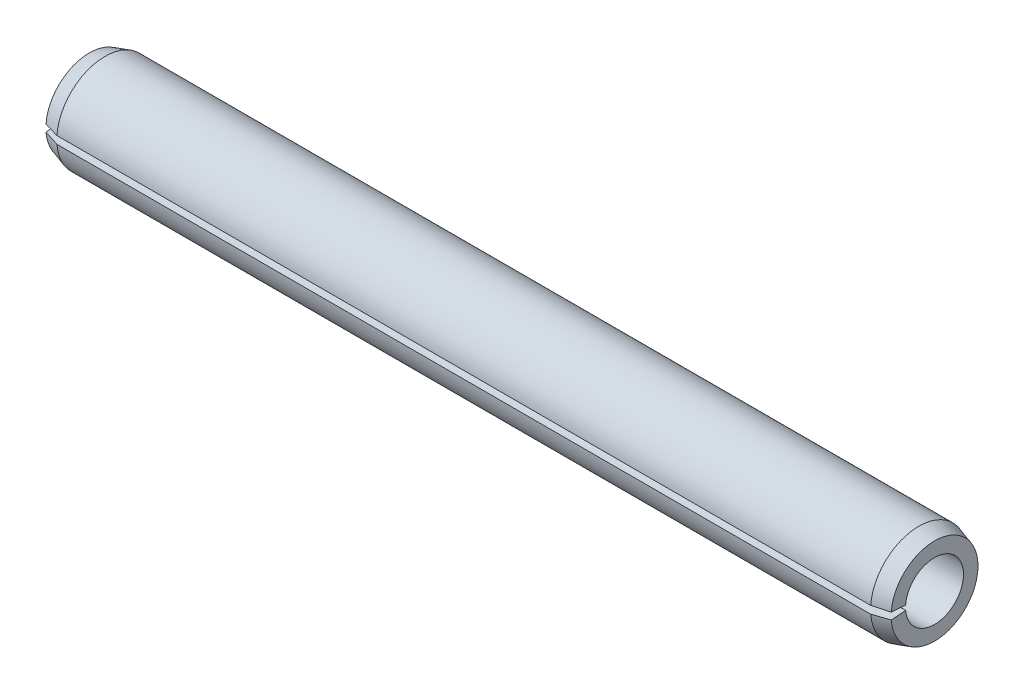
ISO-10303-21;
HEADER;
FILE_DESCRIPTION(('STEP AP214'),'2;1');
FILE_NAME('part.step','',(''),(''),'','','');
FILE_SCHEMA(('AUTOMOTIVE_DESIGN { 1 0 10303 214 1 1 1 1 }'));
ENDSEC;
DATA;
#1=APPLICATION_CONTEXT('core data for automotive mechanical design processes');
#2=APPLICATION_PROTOCOL_DEFINITION('international standard','automotive_design',2000,#1);
#3=PRODUCT_CONTEXT('',#1,'mechanical');
#4=PRODUCT('Part','Part','',(#3));
#5=PRODUCT_RELATED_PRODUCT_CATEGORY('part','',(#4));
#6=PRODUCT_DEFINITION_FORMATION('','',#4);
#7=PRODUCT_DEFINITION_CONTEXT('part definition',#1,'design');
#8=PRODUCT_DEFINITION('design','',#6,#7);
#9=PRODUCT_DEFINITION_SHAPE('','',#8);
#10=(LENGTH_UNIT() NAMED_UNIT(*) SI_UNIT(.MILLI.,.METRE.));
#11=(NAMED_UNIT(*) PLANE_ANGLE_UNIT() SI_UNIT($,.RADIAN.));
#12=(NAMED_UNIT(*) SI_UNIT($,.STERADIAN.) SOLID_ANGLE_UNIT());
#13=UNCERTAINTY_MEASURE_WITH_UNIT(LENGTH_MEASURE(1.E-05),#10,'distance_accuracy_value','');
#14=(GEOMETRIC_REPRESENTATION_CONTEXT(3) GLOBAL_UNCERTAINTY_ASSIGNED_CONTEXT((#13)) GLOBAL_UNIT_ASSIGNED_CONTEXT((#10,
#11,#12)) REPRESENTATION_CONTEXT('',''));
#15=CARTESIAN_POINT('',(0.,0.,0.));
#16=DIRECTION('',(0.,0.,1.));
#17=DIRECTION('',(1.,0.,0.));
#18=AXIS2_PLACEMENT_3D('',#15,#16,#17);
#19=CARTESIAN_POINT('',(0.,1.8,0.));
#20=DIRECTION('',(1.,0.,0.));
#21=DIRECTION('',(0.,0.,-1.));
#22=AXIS2_PLACEMENT_3D('',#19,#20,#21);
#23=PLANE('',#22);
#24=DIRECTION('',(0.,0.0784590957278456,0.996917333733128));
#25=VECTOR('',#24,1.);
#26=CARTESIAN_POINT('',(0.,0.,0.));
#27=LINE('',#26,#25);
#28=CARTESIAN_POINT('',(0.,0.0941509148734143,1.19630080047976));
#29=VERTEX_POINT('',#28);
#30=CARTESIAN_POINT('',(0.,0.141226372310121,1.79445120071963));
#31=VERTEX_POINT('',#30);
#32=EDGE_CURVE('E85',#29,#31,#27,.T.);
#33=ORIENTED_EDGE('',*,*,#32,.T.);
#34=CARTESIAN_POINT('',(0.,0.,0.));
#35=DIRECTION('',(-1.,0.,0.));
#36=DIRECTION('',(0.,0.,1.));
#37=AXIS2_PLACEMENT_3D('',#34,#35,#36);
#38=CIRCLE('',#37,1.8);
#39=CARTESIAN_POINT('',(0.,-0.141226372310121,1.79445120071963));
#40=VERTEX_POINT('',#39);
#41=EDGE_CURVE('E103',#31,#40,#38,.T.);
#42=ORIENTED_EDGE('',*,*,#41,.T.);
#43=DIRECTION('',(0.,-0.0784590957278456,0.996917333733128));
#44=VECTOR('',#43,1.);
#45=CARTESIAN_POINT('',(0.,0.,0.));
#46=LINE('',#45,#44);
#47=CARTESIAN_POINT('',(0.,-0.0941509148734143,1.19630080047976));
#48=VERTEX_POINT('',#47);
#49=EDGE_CURVE('E57',#48,#40,#46,.T.);
#50=ORIENTED_EDGE('',*,*,#49,.F.);
#51=CARTESIAN_POINT('',(0.,0.,0.));
#52=DIRECTION('',(-1.,0.,0.));
#53=DIRECTION('',(0.,0.,1.));
#54=AXIS2_PLACEMENT_3D('',#51,#52,#53);
#55=CIRCLE('',#54,1.2);
#56=EDGE_CURVE('E100',#29,#48,#55,.T.);
#57=ORIENTED_EDGE('',*,*,#56,.F.);
#58=EDGE_LOOP('',(#33,#42,#50,#57));
#59=FACE_BOUND('',#58,.T.);
#60=ADVANCED_FACE('F36',(#59),#23,.F.);
#61=CARTESIAN_POINT('',(-9.52499999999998,0.,0.));
#62=DIRECTION('',(-1.,0.,0.));
#63=DIRECTION('',(0.,0.,1.));
#64=AXIS2_PLACEMENT_3D('',#61,#62,#63);
#65=CYLINDRICAL_SURFACE('',#64,1.2);
#66=DIRECTION('',(-1.,0.,0.));
#67=VECTOR('',#66,1.);
#68=CARTESIAN_POINT('',(-9.52499999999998,0.0941509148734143,1.19630080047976));
#69=LINE('',#68,#67);
#70=CARTESIAN_POINT('',(35.,0.0941509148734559,1.19630080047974));
#71=VERTEX_POINT('',#70);
#72=EDGE_CURVE('E88',#29,#71,#69,.F.);
#73=ORIENTED_EDGE('',*,*,#72,.F.);
#74=ORIENTED_EDGE('',*,*,#56,.T.);
#75=DIRECTION('',(-1.,0.,0.));
#76=VECTOR('',#75,1.);
#77=CARTESIAN_POINT('',(-9.52499999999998,-0.0941509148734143,1.19630080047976));
#78=LINE('',#77,#76);
#79=CARTESIAN_POINT('',(35.,-0.0941509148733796,1.19630080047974));
#80=VERTEX_POINT('',#79);
#81=EDGE_CURVE('E121',#48,#80,#78,.F.);
#82=ORIENTED_EDGE('',*,*,#81,.T.);
#83=CARTESIAN_POINT('',(35.,0.,0.));
#84=DIRECTION('',(-1.,0.,0.));
#85=DIRECTION('',(0.,0.,1.));
#86=AXIS2_PLACEMENT_3D('',#83,#84,#85);
#87=CIRCLE('',#86,1.2);
#88=EDGE_CURVE('E102',#71,#80,#87,.T.);
#89=ORIENTED_EDGE('',*,*,#88,.F.);
#90=EDGE_LOOP('',(#73,#74,#82,#89));
#91=FACE_BOUND('',#90,.T.);
#92=ADVANCED_FACE('F98',(#91),#65,.F.);
#93=CARTESIAN_POINT('',(35.,1.20000000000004,0.));
#94=DIRECTION('',(-1.,0.,0.));
#95=DIRECTION('',(0.,0.,1.));
#96=AXIS2_PLACEMENT_3D('',#93,#94,#95);
#97=PLANE('',#96);
#98=DIRECTION('',(0.,0.0784590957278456,0.996917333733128));
#99=VECTOR('',#98,1.);
#100=CARTESIAN_POINT('',(35.,0.,0.));
#101=LINE('',#100,#99);
#102=CARTESIAN_POINT('',(35.,0.141226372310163,1.79445120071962));
#103=VERTEX_POINT('',#102);
#104=EDGE_CURVE('E132',#71,#103,#101,.T.);
#105=ORIENTED_EDGE('',*,*,#104,.F.);
#106=ORIENTED_EDGE('',*,*,#88,.T.);
#107=DIRECTION('',(0.,-0.0784590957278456,0.996917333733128));
#108=VECTOR('',#107,1.);
#109=CARTESIAN_POINT('',(35.,0.,0.));
#110=LINE('',#109,#108);
#111=CARTESIAN_POINT('',(35.,-0.141226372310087,1.79445120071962));
#112=VERTEX_POINT('',#111);
#113=EDGE_CURVE('E129',#80,#112,#110,.T.);
#114=ORIENTED_EDGE('',*,*,#113,.T.);
#115=CARTESIAN_POINT('',(35.,0.,0.));
#116=DIRECTION('',(-1.,0.,0.));
#117=DIRECTION('',(0.,0.,1.));
#118=AXIS2_PLACEMENT_3D('',#115,#116,#117);
#119=CIRCLE('',#118,1.8);
#120=EDGE_CURVE('E107',#103,#112,#119,.T.);
#121=ORIENTED_EDGE('',*,*,#120,.F.);
#122=EDGE_LOOP('',(#105,#106,#114,#121));
#123=FACE_BOUND('',#122,.T.);
#124=ADVANCED_FACE('F140',(#123),#97,.F.);
#125=CARTESIAN_POINT('',(35.,0.,0.));
#126=DIRECTION('',(-1.,0.,0.));
#127=DIRECTION('',(0.,0.,1.));
#128=AXIS2_PLACEMENT_3D('',#125,#126,#127);
#129=CONICAL_SURFACE('',#128,1.8,0.298498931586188);
#130=DIRECTION('',(-0.955779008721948,0.0230737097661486,0.293179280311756));
#131=VECTOR('',#130,1.);
#132=CARTESIAN_POINT('',(40.8499999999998,0.,0.));
#133=LINE('',#132,#131);
#134=CARTESIAN_POINT('',(34.35,0.156918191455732,1.99383466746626));
#135=VERTEX_POINT('',#134);
#136=EDGE_CURVE('E104',#103,#135,#133,.T.);
#137=ORIENTED_EDGE('',*,*,#136,.F.);
#138=ORIENTED_EDGE('',*,*,#120,.T.);
#139=DIRECTION('',(-0.955779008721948,-0.0230737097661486,0.293179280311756));
#140=VECTOR('',#139,1.);
#141=CARTESIAN_POINT('',(40.8499999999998,0.,0.));
#142=LINE('',#141,#140);
#143=CARTESIAN_POINT('',(34.35,-0.156918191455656,1.99383466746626));
#144=VERTEX_POINT('',#143);
#145=EDGE_CURVE('E123',#112,#144,#142,.T.);
#146=ORIENTED_EDGE('',*,*,#145,.T.);
#147=CARTESIAN_POINT('',(34.35,0.,0.));
#148=DIRECTION('',(-1.,0.,0.));
#149=DIRECTION('',(0.,0.,1.));
#150=AXIS2_PLACEMENT_3D('',#147,#148,#149);
#151=CIRCLE('',#150,2.00000000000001);
#152=EDGE_CURVE('E112',#135,#144,#151,.T.);
#153=ORIENTED_EDGE('',*,*,#152,.F.);
#154=EDGE_LOOP('',(#137,#138,#146,#153));
#155=FACE_BOUND('',#154,.T.);
#156=ADVANCED_FACE('F139',(#155),#129,.T.);
#157=CARTESIAN_POINT('',(-9.52499999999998,0.,0.));
#158=DIRECTION('',(-1.,0.,0.));
#159=DIRECTION('',(0.,0.,1.));
#160=AXIS2_PLACEMENT_3D('',#157,#158,#159);
#161=CYLINDRICAL_SURFACE('',#160,2.);
#162=DIRECTION('',(-1.,0.,0.));
#163=VECTOR('',#162,1.);
#164=CARTESIAN_POINT('',(-9.52499999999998,0.156918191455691,1.99383466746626));
#165=LINE('',#164,#163);
#166=CARTESIAN_POINT('',(0.650000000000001,0.156918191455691,1.99383466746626));
#167=VERTEX_POINT('',#166);
#168=EDGE_CURVE('E49',#135,#167,#165,.T.);
#169=ORIENTED_EDGE('',*,*,#168,.F.);
#170=ORIENTED_EDGE('',*,*,#152,.T.);
#171=DIRECTION('',(-1.,0.,0.));
#172=VECTOR('',#171,1.);
#173=CARTESIAN_POINT('',(-9.52499999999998,-0.156918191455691,1.99383466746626));
#174=LINE('',#173,#172);
#175=CARTESIAN_POINT('',(0.649999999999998,-0.156918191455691,1.99383466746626));
#176=VERTEX_POINT('',#175);
#177=EDGE_CURVE('E126',#144,#176,#174,.T.);
#178=ORIENTED_EDGE('',*,*,#177,.T.);
#179=CARTESIAN_POINT('',(0.649999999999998,0.,0.));
#180=DIRECTION('',(-1.,0.,0.));
#181=DIRECTION('',(0.,0.,1.));
#182=AXIS2_PLACEMENT_3D('',#179,#180,#181);
#183=CIRCLE('',#182,2.);
#184=EDGE_CURVE('E115',#167,#176,#183,.T.);
#185=ORIENTED_EDGE('',*,*,#184,.F.);
#186=EDGE_LOOP('',(#169,#170,#178,#185));
#187=FACE_BOUND('',#186,.T.);
#188=ADVANCED_FACE('F143',(#187),#161,.T.);
#189=CARTESIAN_POINT('',(0.649999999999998,0.,0.));
#190=DIRECTION('',(1.,0.,0.));
#191=DIRECTION('',(0.,0.,-1.));
#192=AXIS2_PLACEMENT_3D('',#189,#190,#191);
#193=CONICAL_SURFACE('',#192,2.,0.29849893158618);
#194=DIRECTION('',(-0.95577900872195,-0.023073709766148,-0.293179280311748));
#195=VECTOR('',#194,1.);
#196=CARTESIAN_POINT('',(-5.84999999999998,0.,0.));
#197=LINE('',#196,#195);
#198=EDGE_CURVE('E11',#167,#31,#197,.T.);
#199=ORIENTED_EDGE('',*,*,#198,.F.);
#200=ORIENTED_EDGE('',*,*,#184,.T.);
#201=DIRECTION('',(-0.95577900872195,0.023073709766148,-0.293179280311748));
#202=VECTOR('',#201,1.);
#203=CARTESIAN_POINT('',(-5.84999999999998,0.,0.));
#204=LINE('',#203,#202);
#205=EDGE_CURVE('E43',#176,#40,#204,.T.);
#206=ORIENTED_EDGE('',*,*,#205,.T.);
#207=ORIENTED_EDGE('',*,*,#41,.F.);
#208=EDGE_LOOP('',(#199,#200,#206,#207));
#209=FACE_BOUND('',#208,.T.);
#210=ADVANCED_FACE('F146',(#209),#193,.T.);
#211=CARTESIAN_POINT('',(35.,0.,0.));
#212=DIRECTION('',(0.,-0.996917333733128,-0.0784590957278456));
#213=DIRECTION('',(0.,0.0784590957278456,-0.996917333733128));
#214=AXIS2_PLACEMENT_3D('',#211,#212,#213);
#215=PLANE('',#214);
#216=ORIENTED_EDGE('',*,*,#49,.T.);
#217=ORIENTED_EDGE('',*,*,#205,.F.);
#218=ORIENTED_EDGE('',*,*,#177,.F.);
#219=ORIENTED_EDGE('',*,*,#145,.F.);
#220=ORIENTED_EDGE('',*,*,#113,.F.);
#221=ORIENTED_EDGE('',*,*,#81,.F.);
#222=EDGE_LOOP('',(#216,#217,#218,#219,#220,#221));
#223=FACE_BOUND('',#222,.T.);
#224=ADVANCED_FACE('F141',(#223),#215,.F.);
#225=CARTESIAN_POINT('',(35.,0.,0.));
#226=DIRECTION('',(0.,-0.996917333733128,0.0784590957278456));
#227=DIRECTION('',(0.,-0.0784590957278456,-0.996917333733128));
#228=AXIS2_PLACEMENT_3D('',#225,#226,#227);
#229=PLANE('',#228);
#230=ORIENTED_EDGE('',*,*,#72,.T.);
#231=ORIENTED_EDGE('',*,*,#104,.T.);
#232=ORIENTED_EDGE('',*,*,#136,.T.);
#233=ORIENTED_EDGE('',*,*,#168,.T.);
#234=ORIENTED_EDGE('',*,*,#198,.T.);
#235=ORIENTED_EDGE('',*,*,#32,.F.);
#236=EDGE_LOOP('',(#230,#231,#232,#233,#234,#235));
#237=FACE_BOUND('',#236,.T.);
#238=ADVANCED_FACE('F87',(#237),#229,.T.);
#239=CLOSED_SHELL('',(#60,#92,#124,#156,#188,#210,#224,#238));
#240=MANIFOLD_SOLID_BREP('B2',#239);
#241=ADVANCED_BREP_SHAPE_REPRESENTATION('',(#18,#240),#14);
#242=SHAPE_DEFINITION_REPRESENTATION(#9,#241);
ENDSEC;
END-ISO-10303-21;
